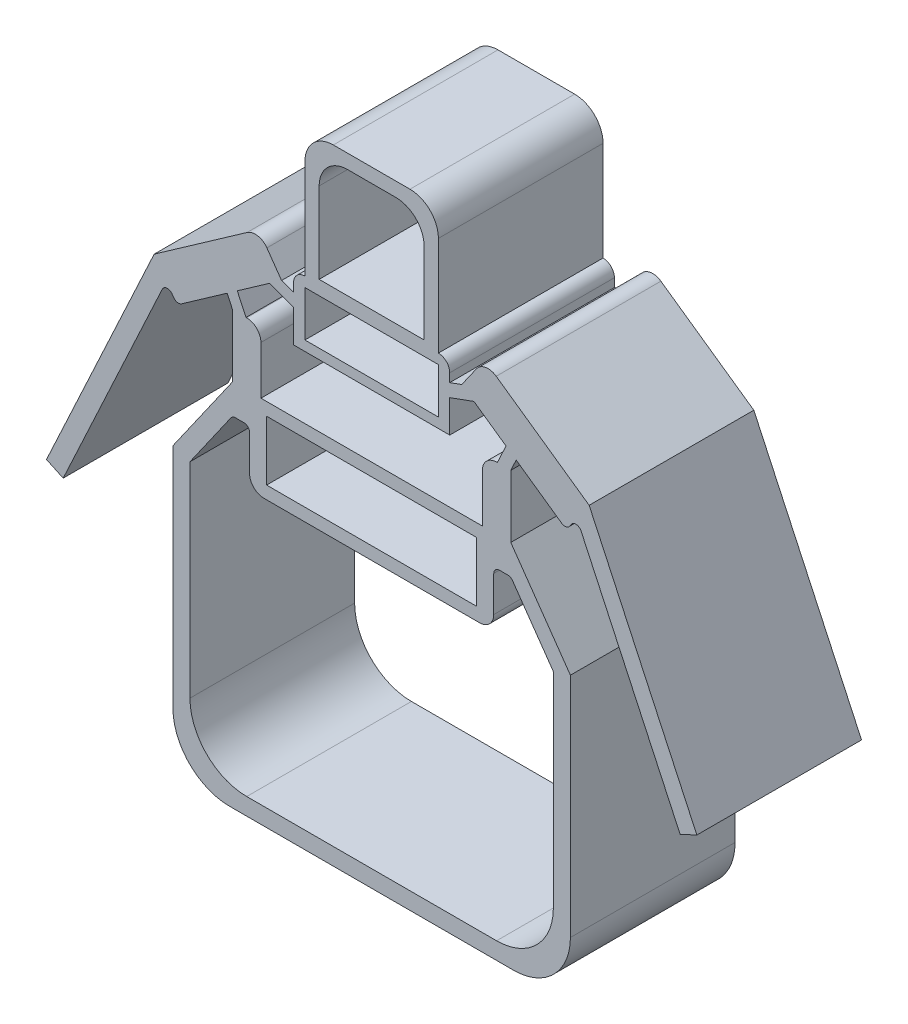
from build123d import *

# Parameters (mm, degrees)
EXTRUDE_1_DEPTH     = 5.8
SKETCH_10_W         = 7.4
SKETCH_10_H         = 2.1
SKETCH_10_W_2       = 4.7
SKETCH_10_H_2       = 1.6
CUT_EXTRUDE_3_DEPTH = 12.600263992
EXTRUDE_2_DEPTH     = 5.8
FILLET_1_R          = 0.4
EXTRUDE_4_DEPTH     = 5.8
SKETCH_13_W         = 7.4
SKETCH_13_H         = 0.1
SKETCH_13_W_2       = 7.8
SKETCH_13_H_2       = 0.2
EXTRUDE_5_DEPTH     = 5.8
SKETCH_14_W         = 7.4
SKETCH_14_H         = 0.1
CUT_EXTRUDE_4_DEPTH = 15.390055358
SKETCH_15_W         = 4.7
SKETCH_15_H         = 4.5
SKETCH_15_W_2       = 3.7
SKETCH_15_H_2       = 3.85
EXTRUDE_6_DEPTH     = 5.8
SKETCH_21_W         = 1
SKETCH_21_H         = 0.253931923
CUT_EXTRUDE_6_DEPTH = 18.302811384
FILLET_2_R          = 0.5
FILLET_3_R          = 1
FILLET_4_R          = 2
SKETCH_23_W         = 0.4
SKETCH_23_H         = 1.953931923
EXTRUDE_16_DEPTH    = 5.8
FILLET_5_R          = 0.2
FILLET_6_R          = 0.5
FILLET_7_R          = 0.2
FILLET_8_R          = 0.5


with BuildPart() as part:
    # Sketch 1 → Extrude 1 (new body)
    with BuildSketch(Plane.XY):
        Polygon((2.75, 5.2), (3.172861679, 5.353909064), (3.977292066, 6.49972395), (7.660268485, 3.914054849), (6.855838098, 2.768239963), (5.090178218, 4.007838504), (4.9, 3.6), (4.9, 0.1), (3.9, 0.1), (3.9, -1.4), (-3.9, -1.4), (-3.9, 1.4), (3.9, 1.4), (3.9, 3.6), (4.425547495, 3.6), (4.732741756, 4.258780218), (3.602114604, 5.05254791), (2.75, 4.742403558), (2.75, 3.6), (-2.75, 3.6), (-2.75, 5.2), align=None)
    extrude_1 = extrude(amount=EXTRUDE_1_DEPTH)

    # Mirror 1: Extrude 1 across plane
    add(extrude_1.mirror(Plane(origin=(0, 0, 0), x_dir=(0, 0, 1), z_dir=(1, 0, 0))))

    # Sketch 10 → Cut-Extrude 3 (cut, through all)
    with BuildSketch(Plane.XY.offset(5.8)):
        Rectangle(SKETCH_10_W, SKETCH_10_H)
        with Locations((0, 4.75)):
            Rectangle(SKETCH_10_W_2, SKETCH_10_H_2)
    extrude(amount=-CUT_EXTRUDE_3_DEPTH, mode=Mode.SUBTRACT)

    # Sketch 11 → Extrude 2 (add)
    with BuildSketch(Plane.XY.offset(5.8)):
        Polygon((-2.35, 5.2), (-2.75, 5.2), (-2.75, 5.9), (2.75, 5.9), (2.75, 5.2), (2.35, 5.2), (2.35, 5.55), (-2.35, 5.55), align=None)
    extrude(amount=-EXTRUDE_2_DEPTH)

    # Fillet 1
    fillet_1_edges = [part.edges().sort_by_distance(p)[0] for p in [
        (2.75, 5.9, 2.9),
        (-2.75, 5.9, 2.9),
    ]]
    fillet(fillet_1_edges, radius=FILLET_1_R)

    # Sketch 12 → Extrude 4 (add)
    with BuildSketch(Plane.XY.offset(5.8)):
        Polygon((7.660268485, 3.914054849), (7.229323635, 3.300225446), (10.864697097, -4.521199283), (11.453701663, -4.247431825), align=None)
        Polygon((-7.660268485, 3.914054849), (-11.453701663, -4.247431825), (-10.864697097, -4.521199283), (-7.229323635, 3.300225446), align=None)
    extrude(amount=-EXTRUDE_4_DEPTH)

    # Sketch 13 → Extrude 5 (add)
    with BuildSketch(Plane.XY.offset(5.8)):
        with Locations((0, 1)):
            Rectangle(SKETCH_13_W, SKETCH_13_H)
        with Locations((0, -1.5)):
            Rectangle(SKETCH_13_W_2, SKETCH_13_H_2)
    extrude(amount=-EXTRUDE_5_DEPTH)

    # Sketch 14 → Cut-Extrude 4 (cut, through all)
    with BuildSketch(Plane.XY.offset(5.8)):
        with Locations((0, -1.1)):
            Rectangle(SKETCH_14_W, SKETCH_14_H)
    extrude(amount=-CUT_EXTRUDE_4_DEPTH, mode=Mode.SUBTRACT)

    # Sketch 15 → Extrude 6 (add)
    # profile 1 of 2: a face of its own
    with BuildSketch(Plane.XY.offset(5.8)):
        with Locations((0, 8.15)):
            Rectangle(SKETCH_15_W, SKETCH_15_H)
        with Locations((0, 7.975)):
            Rectangle(SKETCH_15_W_2, SKETCH_15_H_2, mode=Mode.SUBTRACT)
    # profile 2 of 2: a face of its own
    with BuildSketch(Plane.XY.offset(5.8)):
        Polygon((-7, -1.599110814), (-7, -11.6), (7, -11.6), (7, -1.599110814), (4.9, 1.4), (4.9, 0.353931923), (6.4, -1.788290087), (6.4, -11), (-6.4, -11), (-6.4, -1.788290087), (-4.9, 0.353931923), (-4.9, 1.4), align=None)
    extrude(amount=-EXTRUDE_6_DEPTH)

    # Sketch 21 → Cut-Extrude 6 (cut, through all)
    with BuildSketch(Plane.XY.offset(5.8)):
        with Locations((-4.4, 0.226965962)):
            Rectangle(SKETCH_21_W, SKETCH_21_H)
        with Locations((4.4, 0.226965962)):
            Rectangle(SKETCH_21_W, SKETCH_21_H)
    extrude(amount=-CUT_EXTRUDE_6_DEPTH, mode=Mode.SUBTRACT)

    # Fillet 2
    fillet_2_edges = [part.edges().sort_by_distance(p)[0] for p in [
        (3.9, 3.6, 2.9),
        (-3.9, 3.6, 2.9),
    ]]
    fillet(fillet_2_edges, radius=FILLET_2_R)

    # Fillet 3
    fillet_3_edges = [part.edges().sort_by_distance(p)[0] for p in [
        (-2.35, 10.4, 2.9),
        (2.35, 10.4, 2.9),
        (1.85, 9.9, 2.9),
        (-1.85, 9.9, 2.9),
    ]]
    fillet(fillet_3_edges, radius=FILLET_3_R)

    # Fillet 4
    fillet_4_edges = [part.edges().sort_by_distance(p)[0] for p in [
        (6.4, -11, 2.9),
        (-6.4, -11, 2.9),
        (-7, -11.6, 2.9),
        (7, -11.6, 2.9),
    ]]
    fillet(fillet_4_edges, radius=FILLET_4_R)

    # Sketch 23 → Extrude 16 (add)
    with BuildSketch(Plane.XY.offset(5.8)):
        with Locations((4.1, -0.623034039)):
            Rectangle(SKETCH_23_W, SKETCH_23_H)
        with Locations((-4.1, -0.623034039)):
            Rectangle(SKETCH_23_W, SKETCH_23_H)
    extrude(amount=-EXTRUDE_16_DEPTH)

    # Fillet 5
    fillet_5_edges = [part.edges().sort_by_distance(p)[0] for p in [
        (-4.9, 0.353931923, 2.9),
        (4.9, 0.353931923, 2.9),
        (4.3, 0.353931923, 2.9),
        (-4.3, 0.353931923, 2.9),
    ]]
    fillet(fillet_5_edges, radius=FILLET_5_R)

    # Fillet 6
    fillet_6_edges = [part.edges().sort_by_distance(p)[0] for p in [
        (4.3, -1.6, 2.9),
        (-4.3, -1.6, 2.9),
    ]]
    fillet(fillet_6_edges, radius=FILLET_6_R)

    # Fillet 7
    fillet_7_edges = [part.edges().sort_by_distance(p)[0] for p in [
        (-7.229323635, 3.300225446, 2.9),
        (7.229323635, 3.300225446, 2.9),
        (6.855838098, 2.768239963, 2.9),
        (-6.855838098, 2.768239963, 2.9),
    ]]
    fillet(fillet_7_edges, radius=FILLET_7_R)

    # Fillet 8
    fillet_8_edges = [part.edges().sort_by_distance(p)[0] for p in [
        (3.977292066, 6.49972395, 2.9),
        (-3.977292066, 6.49972395, 2.9),
    ]]
    fillet(fillet_8_edges, radius=FILLET_8_R)


solid = part.part
